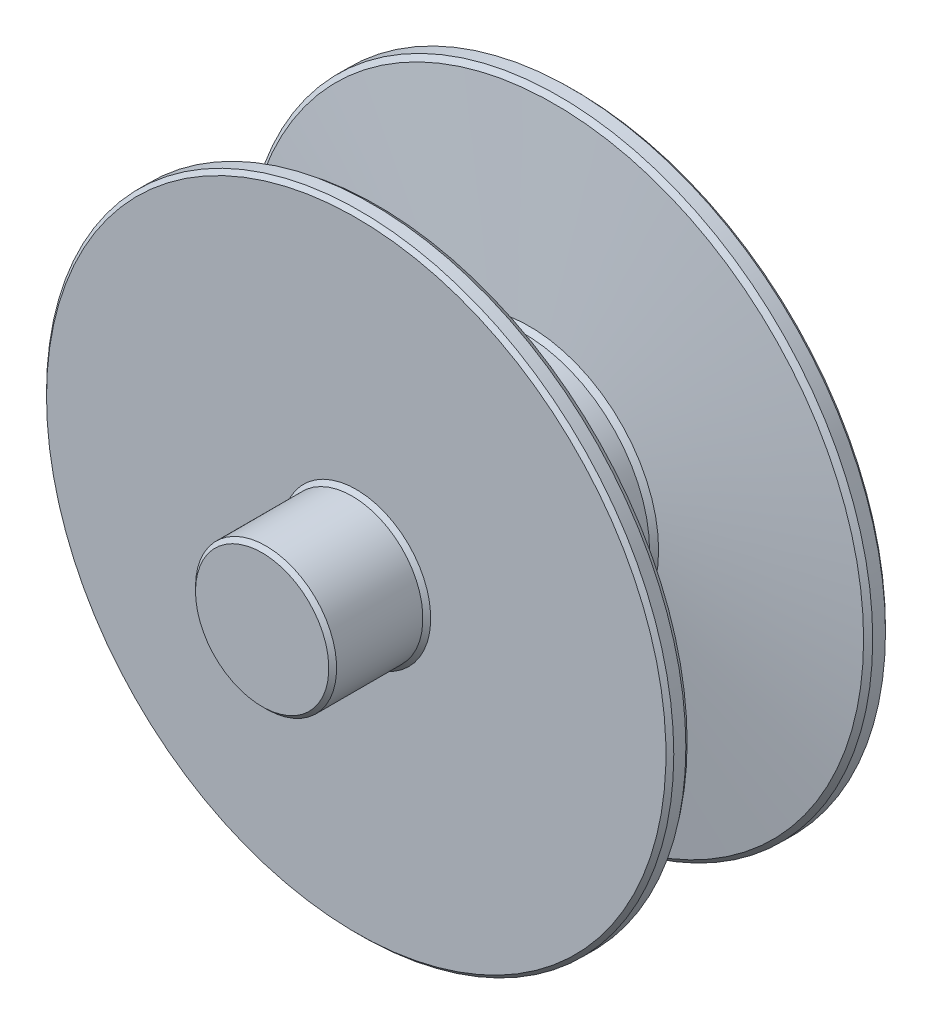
from build123d import *
from OCP.BRepFilletAPI import BRepFilletAPI_MakeChamfer

# Parameters (mm, degrees)
CHAMFER_1_SIZE  = 0.25
CHAMFER_1_SIZE2 = 0.293739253


with BuildPart() as part:
    # Sketch 1 → Revolve 1 (revolve)
    with BuildSketch(Plane(origin=(0, 0, 0), x_dir=(0, 0, -1), z_dir=(1, 0, 0)), mode=Mode.PRIVATE) as revolve_1_sk:
        Polygon((0, 0), (26, 0), (26, 4.5), (20, 4.5), (20, 20), (18.686490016, 20), (17, 8), (9, 8), (7.313509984, 20), (6, 20), (6, 4.5), (0, 4.5), align=None)
    revolve(revolve_1_sk.sketch.rotate(Axis((0, 0, 0), (0, 0, -1)), 90), axis=Axis((0, 0, 0), (0, 0, -1)))

    # Chamfer 1: one chamfer whose edges measure the first distance from different faces: ONE call of the kernel's chamfer builder (chamfer() names one face for all edges)
    chamfer_1_edges_1 = [part.edges().sort_by_distance(p)[0] for p in [
        (-8, 0, -9),
    ]]
    chamfer_1_side_1 = [part.faces().sort_by_distance(p)[0] for p in [
        (-8, 0, -13),
    ]]
    chamfer_1_edges_2 = [part.edges().sort_by_distance(p)[0] for p in [
        (-8, 0, -17),
    ]]
    chamfer_1_side_2 = [part.faces().sort_by_distance(p)[0] for p in [
        (-14, 0, -17.843245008),
    ]]
    chamfer_1_edges_3 = [part.edges().sort_by_distance(p)[0] for p in [
        (-20, 0, -18.686490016),
    ]]
    chamfer_1_side_3 = [part.faces().sort_by_distance(p)[0] for p in [
        (-20, 0, -19.343245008),
    ]]
    chamfer_1_edges_4 = [part.edges().sort_by_distance(p)[0] for p in [
        (-20, 0, -20),
        (-4.5, 0, -20),
        (-4.5, 0, -26),
        (-4.5, 0, 0),
        (-4.5, 0, -6),
        (-20, 0, -6),
    ]]
    chamfer_1_edges_5 = [part.edges().sort_by_distance(p)[0] for p in [
        (-20, 0, -7.313509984),
    ]]
    chamfer_1_side_5 = [part.faces().sort_by_distance(p)[0] for p in [
        (-14, 0, -8.156754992),
    ]]
    chamfer_1 = BRepFilletAPI_MakeChamfer(part.part.solid().wrapped)
    for e in chamfer_1_edges_1:
        chamfer_1.Add(CHAMFER_1_SIZE, CHAMFER_1_SIZE2, e.wrapped, chamfer_1_side_1[0].wrapped)  # the first distance lies on this face
    for e in chamfer_1_edges_2:
        chamfer_1.Add(CHAMFER_1_SIZE, CHAMFER_1_SIZE2, e.wrapped, chamfer_1_side_2[0].wrapped)  # the first distance lies on this face
    for e in chamfer_1_edges_3:
        chamfer_1.Add(CHAMFER_1_SIZE, CHAMFER_1_SIZE2, e.wrapped, chamfer_1_side_3[0].wrapped)  # the first distance lies on this face
    for e in chamfer_1_edges_4:
        chamfer_1.Add(CHAMFER_1_SIZE, e.wrapped)
    for e in chamfer_1_edges_5:
        chamfer_1.Add(CHAMFER_1_SIZE, CHAMFER_1_SIZE2, e.wrapped, chamfer_1_side_5[0].wrapped)  # the first distance lies on this face
    add(Compound.cast(chamfer_1.Shape()), mode=Mode.REPLACE)


solid = part.part
